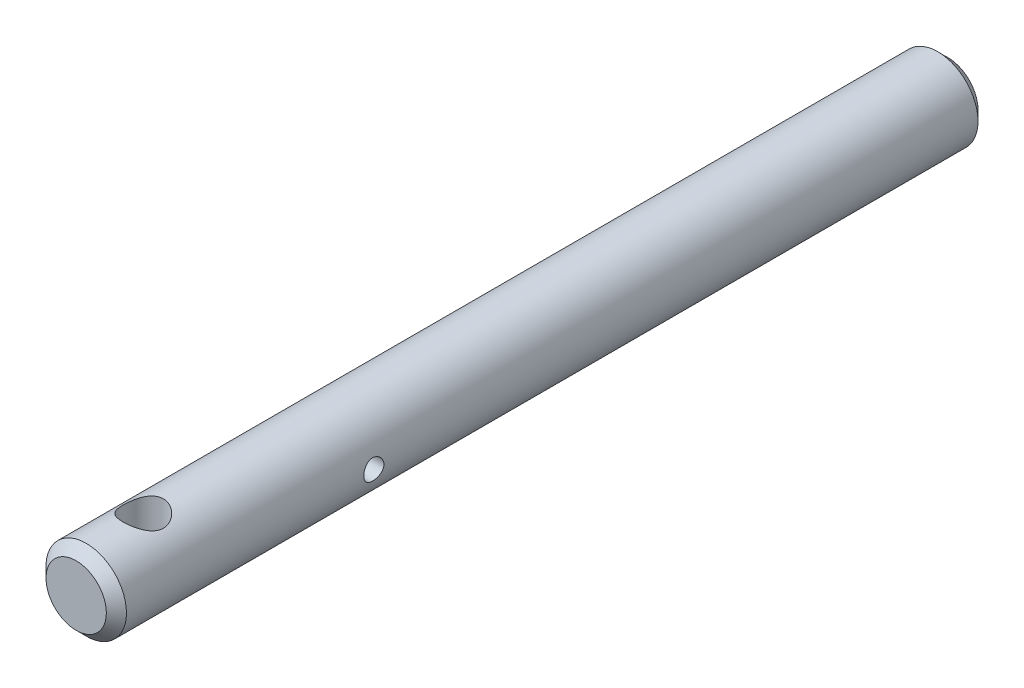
ISO-10303-21;
HEADER;
FILE_DESCRIPTION(('STEP AP214'),'2;1');
FILE_NAME('part.step','',(''),(''),'','','');
FILE_SCHEMA(('AUTOMOTIVE_DESIGN { 1 0 10303 214 1 1 1 1 }'));
ENDSEC;
DATA;
#1=APPLICATION_CONTEXT('core data for automotive mechanical design processes');
#2=APPLICATION_PROTOCOL_DEFINITION('international standard','automotive_design',2000,#1);
#3=PRODUCT_CONTEXT('',#1,'mechanical');
#4=PRODUCT('Part','Part','',(#3));
#5=PRODUCT_RELATED_PRODUCT_CATEGORY('part','',(#4));
#6=PRODUCT_DEFINITION_FORMATION('','',#4);
#7=PRODUCT_DEFINITION_CONTEXT('part definition',#1,'design');
#8=PRODUCT_DEFINITION('design','',#6,#7);
#9=PRODUCT_DEFINITION_SHAPE('','',#8);
#10=(LENGTH_UNIT() NAMED_UNIT(*) SI_UNIT(.MILLI.,.METRE.));
#11=(NAMED_UNIT(*) PLANE_ANGLE_UNIT() SI_UNIT($,.RADIAN.));
#12=(NAMED_UNIT(*) SI_UNIT($,.STERADIAN.) SOLID_ANGLE_UNIT());
#13=UNCERTAINTY_MEASURE_WITH_UNIT(LENGTH_MEASURE(1.E-05),#10,'distance_accuracy_value','');
#14=(GEOMETRIC_REPRESENTATION_CONTEXT(3) GLOBAL_UNCERTAINTY_ASSIGNED_CONTEXT((#13)) GLOBAL_UNIT_ASSIGNED_CONTEXT((#10,
#11,#12)) REPRESENTATION_CONTEXT('',''));
#15=CARTESIAN_POINT('',(0.,0.,0.));
#16=DIRECTION('',(0.,0.,1.));
#17=DIRECTION('',(1.,0.,0.));
#18=AXIS2_PLACEMENT_3D('',#15,#16,#17);
#19=CARTESIAN_POINT('',(0.,0.,-130.));
#20=DIRECTION('',(0.,0.,1.));
#21=DIRECTION('',(1.,0.,0.));
#22=AXIS2_PLACEMENT_3D('',#19,#20,#21);
#23=CYLINDRICAL_SURFACE('',#22,6.);
#24=CARTESIAN_POINT('',(6.,0.,-39.9));
#25=CARTESIAN_POINT('',(5.99999859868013,0.0828760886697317,-39.8999976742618));
#26=CARTESIAN_POINT('',(5.99826578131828,0.165778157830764,-39.8931084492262));
#27=CARTESIAN_POINT('',(5.99152113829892,0.329206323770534,-39.865774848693));
#28=CARTESIAN_POINT('',(5.98650745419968,0.40973104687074,-39.8453227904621));
#29=CARTESIAN_POINT('',(5.9737562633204,0.566020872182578,-39.7915607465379));
#30=CARTESIAN_POINT('',(5.96602202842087,0.641791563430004,-39.7582662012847));
#31=CARTESIAN_POINT('',(5.94865343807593,0.786672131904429,-39.6798186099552));
#32=CARTESIAN_POINT('',(5.9390190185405,0.855781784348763,-39.6346651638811));
#33=CARTESIAN_POINT('',(5.91867413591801,0.986801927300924,-39.5327992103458));
#34=CARTESIAN_POINT('',(5.90794707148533,1.04855569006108,-39.4758884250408));
#35=CARTESIAN_POINT('',(5.8867362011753,1.16174892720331,-39.3525477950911));
#36=CARTESIAN_POINT('',(5.87625242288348,1.21318723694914,-39.2861168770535));
#37=CARTESIAN_POINT('',(5.8565477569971,1.30502654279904,-39.1444047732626));
#38=CARTESIAN_POINT('',(5.84734794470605,1.34525221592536,-39.0690067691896));
#39=CARTESIAN_POINT('',(5.83149494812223,1.41239690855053,-38.9122515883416));
#40=CARTESIAN_POINT('',(5.82484135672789,1.43931805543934,-38.8308953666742));
#41=CARTESIAN_POINT('',(5.81500476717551,1.47855483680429,-38.6662565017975));
#42=CARTESIAN_POINT('',(5.81175491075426,1.49115226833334,-38.5830451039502));
#43=CARTESIAN_POINT('',(5.80889362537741,1.50226177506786,-38.415631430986));
#44=CARTESIAN_POINT('',(5.80928160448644,1.50077614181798,-38.3314293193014));
#45=CARTESIAN_POINT('',(5.81359205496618,1.48398652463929,-38.1665841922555));
#46=CARTESIAN_POINT('',(5.81742863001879,1.46901834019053,-38.0859043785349));
#47=CARTESIAN_POINT('',(5.82806709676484,1.42622418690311,-37.9282389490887));
#48=CARTESIAN_POINT('',(5.83486919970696,1.39839730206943,-37.851253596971));
#49=CARTESIAN_POINT('',(5.85075113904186,1.33038947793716,-37.7022619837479));
#50=CARTESIAN_POINT('',(5.85985327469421,1.29008666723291,-37.6303138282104));
#51=CARTESIAN_POINT('',(5.87929710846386,1.19835627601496,-37.4940812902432));
#52=CARTESIAN_POINT('',(5.88963902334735,1.14692674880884,-37.4297982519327));
#53=CARTESIAN_POINT('',(5.91075880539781,1.03266342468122,-37.3087963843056));
#54=CARTESIAN_POINT('',(5.92154069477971,0.969546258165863,-37.2523455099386));
#55=CARTESIAN_POINT('',(5.94205965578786,0.834611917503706,-37.1507787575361));
#56=CARTESIAN_POINT('',(5.95179669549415,0.76279447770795,-37.1056632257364));
#57=CARTESIAN_POINT('',(5.96917732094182,0.612115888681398,-37.0279494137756));
#58=CARTESIAN_POINT('',(5.97681360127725,0.533231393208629,-36.9953946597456));
#59=CARTESIAN_POINT('',(5.98907916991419,0.370876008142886,-36.9440826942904));
#60=CARTESIAN_POINT('',(5.99370903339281,0.287405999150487,-36.9253228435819));
#61=CARTESIAN_POINT('',(5.99935499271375,0.120539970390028,-36.9025424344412));
#62=CARTESIAN_POINT('',(6.00046053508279,0.0371967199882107,-36.8981569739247));
#63=CARTESIAN_POINT('',(5.99918804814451,-0.129032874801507,-36.9032490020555));
#64=CARTESIAN_POINT('',(5.99681033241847,-0.211919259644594,-36.9127252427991));
#65=CARTESIAN_POINT('',(5.98889581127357,-0.373614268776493,-36.9449709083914));
#66=CARTESIAN_POINT('',(5.98340634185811,-0.452465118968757,-36.967541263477));
#67=CARTESIAN_POINT('',(5.96988706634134,-0.605257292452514,-37.0251070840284));
#68=CARTESIAN_POINT('',(5.96185700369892,-0.679198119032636,-37.0601038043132));
#69=CARTESIAN_POINT('',(5.9439330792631,-0.821523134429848,-37.1422361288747));
#70=CARTESIAN_POINT('',(5.93400867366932,-0.889785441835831,-37.1895761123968));
#71=CARTESIAN_POINT('',(5.91344509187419,-1.01752661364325,-37.294789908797));
#72=CARTESIAN_POINT('',(5.90280579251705,-1.07700395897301,-37.3526655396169));
#73=CARTESIAN_POINT('',(5.88168956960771,-1.18699056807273,-37.4790019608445));
#74=CARTESIAN_POINT('',(5.87122304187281,-1.23724386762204,-37.5476877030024));
#75=CARTESIAN_POINT('',(5.85192878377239,-1.3255107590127,-37.6927326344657));
#76=CARTESIAN_POINT('',(5.84310098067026,-1.36352489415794,-37.7690914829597));
#77=CARTESIAN_POINT('',(5.82818094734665,-1.42595142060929,-37.9269057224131));
#78=CARTESIAN_POINT('',(5.82207255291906,-1.45044439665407,-38.008327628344));
#79=CARTESIAN_POINT('',(5.81326744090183,-1.48534565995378,-38.1743096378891));
#80=CARTESIAN_POINT('',(5.81056997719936,-1.49575702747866,-38.2588690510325));
#81=CARTESIAN_POINT('',(5.80894901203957,-1.502038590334,-38.4261210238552));
#82=CARTESIAN_POINT('',(5.80991932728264,-1.49831789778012,-38.5087974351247));
#83=CARTESIAN_POINT('',(5.81527909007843,-1.47737727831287,-38.672303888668));
#84=CARTESIAN_POINT('',(5.81966846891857,-1.46015762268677,-38.7531339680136));
#85=CARTESIAN_POINT('',(5.83131260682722,-1.4129313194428,-38.9102084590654));
#86=CARTESIAN_POINT('',(5.83855015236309,-1.38300140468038,-38.9864773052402));
#87=CARTESIAN_POINT('',(5.85507755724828,-1.31126491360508,-39.1329653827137));
#88=CARTESIAN_POINT('',(5.86436770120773,-1.26945669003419,-39.2031837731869));
#89=CARTESIAN_POINT('',(5.88425634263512,-1.17386774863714,-39.337554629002));
#90=CARTESIAN_POINT('',(5.89488264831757,-1.11980316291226,-39.401501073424));
#91=CARTESIAN_POINT('',(5.91608027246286,-1.00178937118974,-39.5195470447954));
#92=CARTESIAN_POINT('',(5.9266515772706,-0.937837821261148,-39.573644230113));
#93=CARTESIAN_POINT('',(5.94677655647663,-0.800467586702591,-39.6714113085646));
#94=CARTESIAN_POINT('',(5.95630833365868,-0.726898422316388,-39.7148746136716));
#95=CARTESIAN_POINT('',(5.97304924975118,-0.573266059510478,-39.7887474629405));
#96=CARTESIAN_POINT('',(5.98026005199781,-0.493207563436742,-39.8191663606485));
#97=CARTESIAN_POINT('',(5.99048059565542,-0.344410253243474,-39.8615718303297));
#98=CARTESIAN_POINT('',(5.99402585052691,-0.27638017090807,-39.8759512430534));
#99=CARTESIAN_POINT('',(5.99878605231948,-0.138906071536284,-39.8951659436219));
#100=CARTESIAN_POINT('',(6.00000117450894,-0.0694621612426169,-39.9000019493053));
#101=CARTESIAN_POINT('',(6.,0.,-39.9));
#102=B_SPLINE_CURVE_WITH_KNOTS('',3,(#24,#25,#26,#27,#28,#29,#30,#31,#32,#33,#34,#35,#36,#37,
#38,#39,#40,#41,#42,#43,#44,#45,#46,#47,#48,#49,#50,#51,#52,#53,#54,#55,#56,#57,#58,#59,#60,#61,
#62,#63,#64,#65,#66,#67,#68,#69,#70,#71,#72,#73,#74,#75,#76,#77,#78,#79,#80,#81,#82,#83,#84,#85,
#86,#87,#88,#89,#90,#91,#92,#93,#94,#95,#96,#97,#98,#99,#100,#101),.UNSPECIFIED.,.T.,.F.,(4,2,2,
2,2,2,2,2,2,2,2,2,2,2,2,2,2,2,2,2,2,2,2,2,2,2,2,2,2,2,2,2,2,2,2,2,2,2,4),(0.,0.248373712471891,
0.4968882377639,0.745104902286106,0.993329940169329,1.24614435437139,1.49898729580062,
1.75558647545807,2.01214461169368,2.2635629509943,2.51494038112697,2.76022497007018,
3.00552703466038,3.2533052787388,3.50112690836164,3.7560150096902,4.01091089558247,
4.26668229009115,4.52240473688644,4.77158308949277,5.02073901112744,5.26620274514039,
5.51169127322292,5.76153587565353,6.0114236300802,6.26744509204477,6.5234551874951,
6.77792254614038,7.0323342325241,7.27943780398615,7.52653640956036,7.77216400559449,
8.01782568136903,8.26989576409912,8.5220256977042,8.7787218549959,9.03523363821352,
9.24342242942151,9.45159556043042),.UNSPECIFIED.);
#103=CARTESIAN_POINT('',(6.,0.,-39.9));
#104=VERTEX_POINT('',#103);
#105=EDGE_CURVE('E31',#104,#104,#102,.T.);
#106=ORIENTED_EDGE('',*,*,#105,.F.);
#107=EDGE_LOOP('',(#106));
#108=FACE_BOUND('',#107,.T.);
#109=CARTESIAN_POINT('',(-6.,0.,-39.9));
#110=CARTESIAN_POINT('',(-5.99999859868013,-0.0828760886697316,-39.8999976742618));
#111=CARTESIAN_POINT('',(-5.99826578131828,-0.165778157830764,-39.8931084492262));
#112=CARTESIAN_POINT('',(-5.99152113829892,-0.329206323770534,-39.865774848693));
#113=CARTESIAN_POINT('',(-5.98650745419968,-0.40973104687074,-39.8453227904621));
#114=CARTESIAN_POINT('',(-5.9737562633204,-0.566020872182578,-39.7915607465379));
#115=CARTESIAN_POINT('',(-5.96602202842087,-0.641791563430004,-39.7582662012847));
#116=CARTESIAN_POINT('',(-5.94865343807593,-0.786672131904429,-39.6798186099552));
#117=CARTESIAN_POINT('',(-5.9390190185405,-0.855781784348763,-39.6346651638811));
#118=CARTESIAN_POINT('',(-5.91867413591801,-0.986801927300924,-39.5327992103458));
#119=CARTESIAN_POINT('',(-5.90794707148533,-1.04855569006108,-39.4758884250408));
#120=CARTESIAN_POINT('',(-5.8867362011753,-1.16174892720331,-39.3525477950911));
#121=CARTESIAN_POINT('',(-5.87625242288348,-1.21318723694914,-39.2861168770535));
#122=CARTESIAN_POINT('',(-5.8565477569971,-1.30502654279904,-39.1444047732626));
#123=CARTESIAN_POINT('',(-5.84734794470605,-1.34525221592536,-39.0690067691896));
#124=CARTESIAN_POINT('',(-5.83149494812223,-1.41239690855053,-38.9122515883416));
#125=CARTESIAN_POINT('',(-5.82484135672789,-1.43931805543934,-38.8308953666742));
#126=CARTESIAN_POINT('',(-5.81500476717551,-1.47855483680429,-38.6662565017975));
#127=CARTESIAN_POINT('',(-5.81175491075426,-1.49115226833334,-38.5830451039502));
#128=CARTESIAN_POINT('',(-5.80889362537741,-1.50226177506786,-38.415631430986));
#129=CARTESIAN_POINT('',(-5.80928160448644,-1.50077614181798,-38.3314293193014));
#130=CARTESIAN_POINT('',(-5.81359205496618,-1.48398652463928,-38.1665841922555));
#131=CARTESIAN_POINT('',(-5.81742863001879,-1.46901834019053,-38.0859043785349));
#132=CARTESIAN_POINT('',(-5.82806709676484,-1.42622418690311,-37.9282389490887));
#133=CARTESIAN_POINT('',(-5.83486919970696,-1.39839730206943,-37.851253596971));
#134=CARTESIAN_POINT('',(-5.85075113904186,-1.33038947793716,-37.7022619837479));
#135=CARTESIAN_POINT('',(-5.85985327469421,-1.29008666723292,-37.6303138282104));
#136=CARTESIAN_POINT('',(-5.87929710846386,-1.19835627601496,-37.4940812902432));
#137=CARTESIAN_POINT('',(-5.88963902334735,-1.14692674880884,-37.4297982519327));
#138=CARTESIAN_POINT('',(-5.91075880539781,-1.03266342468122,-37.3087963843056));
#139=CARTESIAN_POINT('',(-5.92154069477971,-0.969546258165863,-37.2523455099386));
#140=CARTESIAN_POINT('',(-5.94205965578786,-0.834611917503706,-37.1507787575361));
#141=CARTESIAN_POINT('',(-5.95179669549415,-0.76279447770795,-37.1056632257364));
#142=CARTESIAN_POINT('',(-5.96917732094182,-0.612115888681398,-37.0279494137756));
#143=CARTESIAN_POINT('',(-5.97681360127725,-0.533231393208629,-36.9953946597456));
#144=CARTESIAN_POINT('',(-5.98907916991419,-0.370876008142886,-36.9440826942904));
#145=CARTESIAN_POINT('',(-5.99370903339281,-0.287405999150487,-36.9253228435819));
#146=CARTESIAN_POINT('',(-5.99935499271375,-0.120539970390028,-36.9025424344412));
#147=CARTESIAN_POINT('',(-6.00046053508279,-0.0371967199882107,-36.8981569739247));
#148=CARTESIAN_POINT('',(-5.99918804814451,0.129032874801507,-36.9032490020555));
#149=CARTESIAN_POINT('',(-5.99681033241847,0.211919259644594,-36.9127252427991));
#150=CARTESIAN_POINT('',(-5.98889581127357,0.373614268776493,-36.9449709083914));
#151=CARTESIAN_POINT('',(-5.98340634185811,0.452465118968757,-36.967541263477));
#152=CARTESIAN_POINT('',(-5.96988706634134,0.605257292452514,-37.0251070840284));
#153=CARTESIAN_POINT('',(-5.96185700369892,0.679198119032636,-37.0601038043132));
#154=CARTESIAN_POINT('',(-5.9439330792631,0.821523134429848,-37.1422361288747));
#155=CARTESIAN_POINT('',(-5.93400867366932,0.889785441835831,-37.1895761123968));
#156=CARTESIAN_POINT('',(-5.91344509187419,1.01752661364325,-37.294789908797));
#157=CARTESIAN_POINT('',(-5.90280579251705,1.07700395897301,-37.3526655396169));
#158=CARTESIAN_POINT('',(-5.88168956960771,1.18699056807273,-37.4790019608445));
#159=CARTESIAN_POINT('',(-5.87122304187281,1.23724386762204,-37.5476877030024));
#160=CARTESIAN_POINT('',(-5.85192878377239,1.3255107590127,-37.6927326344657));
#161=CARTESIAN_POINT('',(-5.84310098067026,1.36352489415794,-37.7690914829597));
#162=CARTESIAN_POINT('',(-5.82818094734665,1.42595142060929,-37.9269057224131));
#163=CARTESIAN_POINT('',(-5.82207255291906,1.45044439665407,-38.008327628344));
#164=CARTESIAN_POINT('',(-5.81326744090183,1.48534565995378,-38.1743096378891));
#165=CARTESIAN_POINT('',(-5.81056997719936,1.49575702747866,-38.2588690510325));
#166=CARTESIAN_POINT('',(-5.80894901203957,1.502038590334,-38.4261210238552));
#167=CARTESIAN_POINT('',(-5.80991932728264,1.49831789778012,-38.5087974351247));
#168=CARTESIAN_POINT('',(-5.81527909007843,1.47737727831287,-38.672303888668));
#169=CARTESIAN_POINT('',(-5.81966846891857,1.46015762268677,-38.7531339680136));
#170=CARTESIAN_POINT('',(-5.83131260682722,1.4129313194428,-38.9102084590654));
#171=CARTESIAN_POINT('',(-5.83855015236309,1.38300140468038,-38.9864773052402));
#172=CARTESIAN_POINT('',(-5.85507755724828,1.31126491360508,-39.1329653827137));
#173=CARTESIAN_POINT('',(-5.86436770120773,1.26945669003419,-39.2031837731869));
#174=CARTESIAN_POINT('',(-5.88425634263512,1.17386774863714,-39.337554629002));
#175=CARTESIAN_POINT('',(-5.89488264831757,1.11980316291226,-39.401501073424));
#176=CARTESIAN_POINT('',(-5.91608027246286,1.00178937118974,-39.5195470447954));
#177=CARTESIAN_POINT('',(-5.9266515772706,0.937837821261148,-39.573644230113));
#178=CARTESIAN_POINT('',(-5.94677655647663,0.80046758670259,-39.6714113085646));
#179=CARTESIAN_POINT('',(-5.95630833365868,0.726898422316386,-39.7148746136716));
#180=CARTESIAN_POINT('',(-5.97304924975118,0.573266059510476,-39.7887474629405));
#181=CARTESIAN_POINT('',(-5.98026005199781,0.493207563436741,-39.8191663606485));
#182=CARTESIAN_POINT('',(-5.99048059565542,0.344410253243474,-39.8615718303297));
#183=CARTESIAN_POINT('',(-5.99402585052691,0.276380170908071,-39.8759512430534));
#184=CARTESIAN_POINT('',(-5.99878605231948,0.138906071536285,-39.8951659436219));
#185=CARTESIAN_POINT('',(-6.00000117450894,0.0694621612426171,-39.9000019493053));
#186=CARTESIAN_POINT('',(-6.,0.,-39.9));
#187=B_SPLINE_CURVE_WITH_KNOTS('',3,(#109,#110,#111,#112,#113,#114,#115,#116,#117,#118,#119,
#120,#121,#122,#123,#124,#125,#126,#127,#128,#129,#130,#131,#132,#133,#134,#135,#136,#137,#138,
#139,#140,#141,#142,#143,#144,#145,#146,#147,#148,#149,#150,#151,#152,#153,#154,#155,#156,#157,
#158,#159,#160,#161,#162,#163,#164,#165,#166,#167,#168,#169,#170,#171,#172,#173,#174,#175,#176,
#177,#178,#179,#180,#181,#182,#183,#184,#185,#186),.UNSPECIFIED.,.T.,.F.,(4,2,2,2,2,2,2,2,2,2,2,
2,2,2,2,2,2,2,2,2,2,2,2,2,2,2,2,2,2,2,2,2,2,2,2,2,2,2,4),(0.,0.248373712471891,
0.496888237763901,0.745104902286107,0.99332994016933,1.24614435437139,1.49898729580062,
1.75558647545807,2.01214461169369,2.2635629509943,2.51494038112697,2.76022497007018,
3.00552703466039,3.25330527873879,3.50112690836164,3.7560150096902,4.01091089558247,
4.26668229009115,4.52240473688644,4.77158308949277,5.02073901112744,5.26620274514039,
5.51169127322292,5.76153587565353,6.0114236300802,6.26744509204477,6.5234551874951,
6.77792254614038,7.0323342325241,7.27943780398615,7.52653640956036,7.77216400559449,
8.01782568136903,8.26989576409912,8.5220256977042,8.7787218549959,9.03523363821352,
9.24342242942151,9.45159556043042),.UNSPECIFIED.);
#188=CARTESIAN_POINT('',(-6.,0.,-39.9));
#189=VERTEX_POINT('',#188);
#190=EDGE_CURVE('E105',#189,#189,#187,.T.);
#191=ORIENTED_EDGE('',*,*,#190,.F.);
#192=EDGE_LOOP('',(#191));
#193=FACE_BOUND('',#192,.T.);
#194=CARTESIAN_POINT('',(0.,-6.,-7.));
#195=CARTESIAN_POINT('',(-0.0788941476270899,-5.99999934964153,-7.00000083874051));
#196=CARTESIAN_POINT('',(-0.15779662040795,-5.99843869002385,-7.00311794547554));
#197=CARTESIAN_POINT('',(-0.315001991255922,-5.99224358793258,-7.01553927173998));
#198=CARTESIAN_POINT('',(-0.393304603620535,-5.98760776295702,-7.02484627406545));
#199=CARTESIAN_POINT('',(-0.626628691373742,-5.96921978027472,-7.06195785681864));
#200=CARTESIAN_POINT('',(-0.779952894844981,-5.95098734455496,-7.09895282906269));
#201=CARTESIAN_POINT('',(-1.07683586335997,-5.90448966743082,-7.19558177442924));
#202=CARTESIAN_POINT('',(-1.22043005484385,-5.87626344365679,-7.25512776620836));
#203=CARTESIAN_POINT('',(-1.49540820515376,-5.81237302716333,-7.39471125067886));
#204=CARTESIAN_POINT('',(-1.62679312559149,-5.77670942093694,-7.47474712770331));
#205=CARTESIAN_POINT('',(-1.88252701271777,-5.69868752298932,-7.65855398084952));
#206=CARTESIAN_POINT('',(-2.0059694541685,-5.65605474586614,-7.76346794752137));
#207=CARTESIAN_POINT('',(-2.23433451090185,-5.56980033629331,-7.99155592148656));
#208=CARTESIAN_POINT('',(-2.33924301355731,-5.5261779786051,-8.11474371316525));
#209=CARTESIAN_POINT('',(-2.53576864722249,-5.43896347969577,-8.38748436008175));
#210=CARTESIAN_POINT('',(-2.62572411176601,-5.39563602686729,-8.53834097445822));
#211=CARTESIAN_POINT('',(-2.7403403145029,-5.33782449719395,-8.77595085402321));
#212=CARTESIAN_POINT('',(-2.77516786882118,-5.31974570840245,-8.85707092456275));
#213=CARTESIAN_POINT('',(-2.83769299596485,-5.28665768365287,-9.02260057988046));
#214=CARTESIAN_POINT('',(-2.86539478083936,-5.27164663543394,-9.10700818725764));
#215=CARTESIAN_POINT('',(-2.91188280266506,-5.24610341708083,-9.27339579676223));
#216=CARTESIAN_POINT('',(-2.93110042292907,-5.23535838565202,-9.35522279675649));
#217=CARTESIAN_POINT('',(-2.9626355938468,-5.21757784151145,-9.5205549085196));
#218=CARTESIAN_POINT('',(-2.9749568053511,-5.21054036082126,-9.60405910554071));
#219=CARTESIAN_POINT('',(-2.99251382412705,-5.20047756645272,-9.77200636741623));
#220=CARTESIAN_POINT('',(-2.99775389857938,-5.19744983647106,-9.85644883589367));
#221=CARTESIAN_POINT('',(-3.00108452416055,-5.19552555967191,-10.0254936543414));
#222=CARTESIAN_POINT('',(-2.99917575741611,-5.19662861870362,-10.1100959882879));
#223=CARTESIAN_POINT('',(-2.98404973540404,-5.20534668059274,-10.3427538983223));
#224=CARTESIAN_POINT('',(-2.96335042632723,-5.21726794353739,-10.4902441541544));
#225=CARTESIAN_POINT('',(-2.90082280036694,-5.25228182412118,-10.7791936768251));
#226=CARTESIAN_POINT('',(-2.85898775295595,-5.2753780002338,-10.9206510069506));
#227=CARTESIAN_POINT('',(-2.75462843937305,-5.33062568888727,-11.1976796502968));
#228=CARTESIAN_POINT('',(-2.69164495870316,-5.36297559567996,-11.3330371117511));
#229=CARTESIAN_POINT('',(-2.54712530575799,-5.43310175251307,-11.591904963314));
#230=CARTESIAN_POINT('',(-2.46558080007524,-5.47088043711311,-11.7154099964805));
#231=CARTESIAN_POINT('',(-2.27419808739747,-5.55339485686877,-11.9635630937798));
#232=CARTESIAN_POINT('',(-2.16208335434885,-5.59840533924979,-12.0863704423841));
#233=CARTESIAN_POINT('',(-1.91866675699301,-5.6864286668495,-12.3122064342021));
#234=CARTESIAN_POINT('',(-1.78735577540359,-5.72944054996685,-12.4152256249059));
#235=CARTESIAN_POINT('',(-1.50154951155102,-5.81105962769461,-12.6030569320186));
#236=CARTESIAN_POINT('',(-1.3462607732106,-5.84936952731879,-12.6868014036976));
#237=CARTESIAN_POINT('',(-1.02139864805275,-5.91473643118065,-12.8262911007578));
#238=CARTESIAN_POINT('',(-0.851836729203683,-5.94180236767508,-12.8820585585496));
#239=CARTESIAN_POINT('',(-0.518299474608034,-5.97973001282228,-12.9594262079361));
#240=CARTESIAN_POINT('',(-0.355024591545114,-5.99174814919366,-12.9834737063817));
#241=CARTESIAN_POINT('',(-0.0263387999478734,-6.00219040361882,-13.0043941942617));
#242=CARTESIAN_POINT('',(0.139071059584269,-6.00062096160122,-13.0012800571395));
#243=CARTESIAN_POINT('',(0.453698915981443,-5.98473576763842,-12.9693799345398));
#244=CARTESIAN_POINT('',(0.603178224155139,-5.97141737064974,-12.9426024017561));
#245=CARTESIAN_POINT('',(0.895220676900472,-5.93466513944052,-12.8672857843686));
#246=CARTESIAN_POINT('',(1.03778305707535,-5.91123019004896,-12.8187443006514));
#247=CARTESIAN_POINT('',(1.31666582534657,-5.85552754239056,-12.7000046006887));
#248=CARTESIAN_POINT('',(1.45269119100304,-5.82302645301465,-12.6292268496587));
#249=CARTESIAN_POINT('',(1.71138408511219,-5.75231922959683,-12.4686773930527));
#250=CARTESIAN_POINT('',(1.83404588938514,-5.71411066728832,-12.3788975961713));
#251=CARTESIAN_POINT('',(2.07530306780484,-5.63124663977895,-12.1727187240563));
#252=CARTESIAN_POINT('',(2.19231623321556,-5.58632654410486,-12.0545713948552));
#253=CARTESIAN_POINT('',(2.40556896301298,-5.49787174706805,-11.8002245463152));
#254=CARTESIAN_POINT('',(2.50179415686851,-5.4543380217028,-11.6640126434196));
#255=CARTESIAN_POINT('',(2.675123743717,-5.3715357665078,-11.3690690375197));
#256=CARTESIAN_POINT('',(2.75107648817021,-5.33257588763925,-11.2095662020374));
#257=CARTESIAN_POINT('',(2.87424847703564,-5.26722216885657,-10.8774697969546));
#258=CARTESIAN_POINT('',(2.92150474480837,-5.24081214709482,-10.7048934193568));
#259=CARTESIAN_POINT('',(2.98158506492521,-5.2068450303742,-10.3692693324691));
#260=CARTESIAN_POINT('',(2.997278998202,-5.19772150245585,-10.2068972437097));
#261=CARTESIAN_POINT('',(3.00206745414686,-5.19496064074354,-9.88165879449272));
#262=CARTESIAN_POINT('',(2.99117350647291,-5.20131659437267,-9.71879267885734));
#263=CARTESIAN_POINT('',(2.94577840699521,-5.22713585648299,-9.41354950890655));
#264=CARTESIAN_POINT('',(2.91362505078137,-5.24529281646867,-9.27069863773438));
#265=CARTESIAN_POINT('',(2.82952596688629,-5.29113050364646,-8.9925755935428));
#266=CARTESIAN_POINT('',(2.77757387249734,-5.3188142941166,-8.85730587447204));
#267=CARTESIAN_POINT('',(2.65144766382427,-5.38285583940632,-8.58812563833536));
#268=CARTESIAN_POINT('',(2.57601505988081,-5.41967139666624,-8.45491703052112));
#269=CARTESIAN_POINT('',(2.40645126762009,-5.49706022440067,-8.2021756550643));
#270=CARTESIAN_POINT('',(2.31231035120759,-5.53763544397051,-8.08265005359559));
#271=CARTESIAN_POINT('',(2.094616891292,-5.62386853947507,-7.84557714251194));
#272=CARTESIAN_POINT('',(1.96888052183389,-5.66954494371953,-7.73003487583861));
#273=CARTESIAN_POINT('',(1.69843715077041,-5.75633712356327,-7.52119885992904));
#274=CARTESIAN_POINT('',(1.55371998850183,-5.79745043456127,-7.42791710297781));
#275=CARTESIAN_POINT('',(1.32452333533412,-5.85251406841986,-7.30682181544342));
#276=CARTESIAN_POINT('',(1.24575314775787,-5.86982524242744,-7.26947979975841));
#277=CARTESIAN_POINT('',(1.08479725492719,-5.90168845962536,-7.20163832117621));
#278=CARTESIAN_POINT('',(1.00261324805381,-5.91624185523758,-7.17113550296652));
#279=CARTESIAN_POINT('',(0.835616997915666,-5.94212690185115,-7.11739274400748));
#280=CARTESIAN_POINT('',(0.750810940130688,-5.95346557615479,-7.09413695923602));
#281=CARTESIAN_POINT('',(0.579142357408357,-5.97260771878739,-7.05511742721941));
#282=CARTESIAN_POINT('',(0.492281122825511,-5.98041334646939,-7.03934910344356));
#283=CARTESIAN_POINT('',(0.337824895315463,-5.99085829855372,-7.01831532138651));
#284=CARTESIAN_POINT('',(0.270495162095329,-5.99428035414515,-7.01145308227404));
#285=CARTESIAN_POINT('',(0.135445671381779,-5.99885151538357,-7.00229499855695));
#286=CARTESIAN_POINT('',(0.0677259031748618,-6.00000055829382,-6.99999927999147));
#287=CARTESIAN_POINT('',(0.,-6.,-7.));
#288=B_SPLINE_CURVE_WITH_KNOTS('',3,(#194,#195,#196,#197,#198,#199,#200,#201,#202,#203,#204,
#205,#206,#207,#208,#209,#210,#211,#212,#213,#214,#215,#216,#217,#218,#219,#220,#221,#222,#223,
#224,#225,#226,#227,#228,#229,#230,#231,#232,#233,#234,#235,#236,#237,#238,#239,#240,#241,#242,
#243,#244,#245,#246,#247,#248,#249,#250,#251,#252,#253,#254,#255,#256,#257,#258,#259,#260,#261,
#262,#263,#264,#265,#266,#267,#268,#269,#270,#271,#272,#273,#274,#275,#276,#277,#278,#279,#280,
#281,#282,#283,#284,#285,#286,#287),.UNSPECIFIED.,.T.,.F.,(4,2,2,2,2,2,2,2,2,2,2,2,2,2,2,2,2,2,
2,2,2,2,2,2,2,2,2,2,2,2,2,2,2,2,2,2,2,2,2,2,2,2,2,2,2,2,4),(0.,0.236611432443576,
0.4733293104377,0.947100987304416,1.41904300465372,1.89094781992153,2.39140181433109,
2.89223525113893,3.43190833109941,3.70192714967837,3.97178599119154,4.2256372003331,
4.47935352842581,4.73291689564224,4.98645606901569,5.43238672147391,5.87845946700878,
6.33492255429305,6.79159098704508,7.30616358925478,7.82098138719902,8.35970601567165,
8.89800185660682,9.3917140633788,9.88519228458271,10.3404225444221,10.7957029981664,
11.2640010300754,11.7324988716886,12.2470036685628,12.7618630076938,13.3016558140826,
13.8407507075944,14.3280945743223,14.8152271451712,15.2559532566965,15.6968212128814,
16.1673090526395,16.6380421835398,17.1659726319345,17.6941868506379,17.9605054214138,
18.2266930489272,18.4922945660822,18.7577335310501,18.9608446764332,19.1639614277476),.UNSPECIFIED.);
#289=CARTESIAN_POINT('',(0.,-6.,-7.));
#290=VERTEX_POINT('',#289);
#291=EDGE_CURVE('E53',#290,#290,#288,.T.);
#292=ORIENTED_EDGE('',*,*,#291,.F.);
#293=EDGE_LOOP('',(#292));
#294=FACE_BOUND('',#293,.T.);
#295=CARTESIAN_POINT('',(0.,6.,-7.));
#296=CARTESIAN_POINT('',(0.0788941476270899,5.99999934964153,-7.00000083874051));
#297=CARTESIAN_POINT('',(0.15779662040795,5.99843869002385,-7.00311794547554));
#298=CARTESIAN_POINT('',(0.315001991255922,5.99224358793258,-7.01553927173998));
#299=CARTESIAN_POINT('',(0.393304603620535,5.98760776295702,-7.02484627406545));
#300=CARTESIAN_POINT('',(0.626628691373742,5.96921978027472,-7.06195785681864));
#301=CARTESIAN_POINT('',(0.779952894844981,5.95098734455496,-7.09895282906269));
#302=CARTESIAN_POINT('',(1.07683586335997,5.90448966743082,-7.19558177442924));
#303=CARTESIAN_POINT('',(1.22043005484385,5.87626344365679,-7.25512776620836));
#304=CARTESIAN_POINT('',(1.49540820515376,5.81237302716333,-7.39471125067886));
#305=CARTESIAN_POINT('',(1.62679312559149,5.77670942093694,-7.47474712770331));
#306=CARTESIAN_POINT('',(1.88252701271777,5.69868752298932,-7.65855398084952));
#307=CARTESIAN_POINT('',(2.0059694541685,5.65605474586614,-7.76346794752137));
#308=CARTESIAN_POINT('',(2.23433451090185,5.56980033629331,-7.99155592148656));
#309=CARTESIAN_POINT('',(2.33924301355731,5.5261779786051,-8.11474371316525));
#310=CARTESIAN_POINT('',(2.53576864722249,5.43896347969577,-8.38748436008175));
#311=CARTESIAN_POINT('',(2.62572411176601,5.39563602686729,-8.53834097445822));
#312=CARTESIAN_POINT('',(2.7403403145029,5.33782449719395,-8.77595085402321));
#313=CARTESIAN_POINT('',(2.77516786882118,5.31974570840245,-8.85707092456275));
#314=CARTESIAN_POINT('',(2.83769299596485,5.28665768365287,-9.02260057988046));
#315=CARTESIAN_POINT('',(2.86539478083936,5.27164663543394,-9.10700818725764));
#316=CARTESIAN_POINT('',(2.91188280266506,5.24610341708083,-9.27339579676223));
#317=CARTESIAN_POINT('',(2.93110042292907,5.23535838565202,-9.35522279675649));
#318=CARTESIAN_POINT('',(2.9626355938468,5.21757784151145,-9.5205549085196));
#319=CARTESIAN_POINT('',(2.9749568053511,5.21054036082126,-9.60405910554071));
#320=CARTESIAN_POINT('',(2.99251382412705,5.20047756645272,-9.77200636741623));
#321=CARTESIAN_POINT('',(2.99775389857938,5.19744983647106,-9.85644883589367));
#322=CARTESIAN_POINT('',(3.00108452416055,5.19552555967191,-10.0254936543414));
#323=CARTESIAN_POINT('',(2.99917575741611,5.19662861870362,-10.1100959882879));
#324=CARTESIAN_POINT('',(2.98404973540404,5.20534668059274,-10.3427538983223));
#325=CARTESIAN_POINT('',(2.96335042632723,5.21726794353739,-10.4902441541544));
#326=CARTESIAN_POINT('',(2.90082280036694,5.25228182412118,-10.7791936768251));
#327=CARTESIAN_POINT('',(2.85898775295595,5.2753780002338,-10.9206510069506));
#328=CARTESIAN_POINT('',(2.75462843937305,5.33062568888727,-11.1976796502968));
#329=CARTESIAN_POINT('',(2.69164495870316,5.36297559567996,-11.3330371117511));
#330=CARTESIAN_POINT('',(2.54712530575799,5.43310175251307,-11.591904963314));
#331=CARTESIAN_POINT('',(2.46558080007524,5.47088043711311,-11.7154099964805));
#332=CARTESIAN_POINT('',(2.27419808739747,5.55339485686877,-11.9635630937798));
#333=CARTESIAN_POINT('',(2.16208335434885,5.59840533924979,-12.0863704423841));
#334=CARTESIAN_POINT('',(1.91866675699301,5.6864286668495,-12.3122064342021));
#335=CARTESIAN_POINT('',(1.78735577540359,5.72944054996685,-12.4152256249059));
#336=CARTESIAN_POINT('',(1.50154951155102,5.81105962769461,-12.6030569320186));
#337=CARTESIAN_POINT('',(1.3462607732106,5.84936952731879,-12.6868014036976));
#338=CARTESIAN_POINT('',(1.02139864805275,5.91473643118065,-12.8262911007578));
#339=CARTESIAN_POINT('',(0.851836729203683,5.94180236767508,-12.8820585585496));
#340=CARTESIAN_POINT('',(0.518299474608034,5.97973001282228,-12.9594262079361));
#341=CARTESIAN_POINT('',(0.355024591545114,5.99174814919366,-12.9834737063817));
#342=CARTESIAN_POINT('',(0.0263387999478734,6.00219040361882,-13.0043941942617));
#343=CARTESIAN_POINT('',(-0.139071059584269,6.00062096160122,-13.0012800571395));
#344=CARTESIAN_POINT('',(-0.453698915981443,5.98473576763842,-12.9693799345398));
#345=CARTESIAN_POINT('',(-0.603178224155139,5.97141737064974,-12.9426024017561));
#346=CARTESIAN_POINT('',(-0.895220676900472,5.93466513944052,-12.8672857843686));
#347=CARTESIAN_POINT('',(-1.03778305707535,5.91123019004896,-12.8187443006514));
#348=CARTESIAN_POINT('',(-1.31666582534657,5.85552754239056,-12.7000046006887));
#349=CARTESIAN_POINT('',(-1.45269119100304,5.82302645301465,-12.6292268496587));
#350=CARTESIAN_POINT('',(-1.71138408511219,5.75231922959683,-12.4686773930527));
#351=CARTESIAN_POINT('',(-1.83404588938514,5.71411066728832,-12.3788975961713));
#352=CARTESIAN_POINT('',(-2.07530306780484,5.63124663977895,-12.1727187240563));
#353=CARTESIAN_POINT('',(-2.19231623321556,5.58632654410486,-12.0545713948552));
#354=CARTESIAN_POINT('',(-2.40556896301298,5.49787174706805,-11.8002245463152));
#355=CARTESIAN_POINT('',(-2.50179415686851,5.4543380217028,-11.6640126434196));
#356=CARTESIAN_POINT('',(-2.675123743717,5.3715357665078,-11.3690690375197));
#357=CARTESIAN_POINT('',(-2.75107648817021,5.33257588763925,-11.2095662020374));
#358=CARTESIAN_POINT('',(-2.87424847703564,5.26722216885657,-10.8774697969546));
#359=CARTESIAN_POINT('',(-2.92150474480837,5.24081214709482,-10.7048934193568));
#360=CARTESIAN_POINT('',(-2.98158506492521,5.2068450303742,-10.3692693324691));
#361=CARTESIAN_POINT('',(-2.997278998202,5.19772150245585,-10.2068972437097));
#362=CARTESIAN_POINT('',(-3.00206745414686,5.19496064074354,-9.88165879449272));
#363=CARTESIAN_POINT('',(-2.99117350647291,5.20131659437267,-9.71879267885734));
#364=CARTESIAN_POINT('',(-2.94577840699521,5.22713585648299,-9.41354950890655));
#365=CARTESIAN_POINT('',(-2.91362505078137,5.24529281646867,-9.27069863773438));
#366=CARTESIAN_POINT('',(-2.82952596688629,5.29113050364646,-8.9925755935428));
#367=CARTESIAN_POINT('',(-2.77757387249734,5.3188142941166,-8.85730587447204));
#368=CARTESIAN_POINT('',(-2.65144766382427,5.38285583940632,-8.58812563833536));
#369=CARTESIAN_POINT('',(-2.57601505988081,5.41967139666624,-8.45491703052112));
#370=CARTESIAN_POINT('',(-2.40645126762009,5.49706022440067,-8.2021756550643));
#371=CARTESIAN_POINT('',(-2.31231035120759,5.53763544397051,-8.08265005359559));
#372=CARTESIAN_POINT('',(-2.094616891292,5.62386853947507,-7.84557714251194));
#373=CARTESIAN_POINT('',(-1.96888052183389,5.66954494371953,-7.73003487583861));
#374=CARTESIAN_POINT('',(-1.69843715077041,5.75633712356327,-7.52119885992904));
#375=CARTESIAN_POINT('',(-1.55371998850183,5.79745043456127,-7.42791710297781));
#376=CARTESIAN_POINT('',(-1.32452333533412,5.85251406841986,-7.30682181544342));
#377=CARTESIAN_POINT('',(-1.24575314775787,5.86982524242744,-7.26947979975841));
#378=CARTESIAN_POINT('',(-1.08479725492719,5.90168845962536,-7.20163832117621));
#379=CARTESIAN_POINT('',(-1.00261324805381,5.91624185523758,-7.17113550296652));
#380=CARTESIAN_POINT('',(-0.835616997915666,5.94212690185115,-7.11739274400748));
#381=CARTESIAN_POINT('',(-0.750810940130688,5.95346557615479,-7.09413695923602));
#382=CARTESIAN_POINT('',(-0.579142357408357,5.97260771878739,-7.05511742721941));
#383=CARTESIAN_POINT('',(-0.492281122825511,5.98041334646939,-7.03934910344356));
#384=CARTESIAN_POINT('',(-0.337824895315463,5.99085829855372,-7.01831532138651));
#385=CARTESIAN_POINT('',(-0.270495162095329,5.99428035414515,-7.01145308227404));
#386=CARTESIAN_POINT('',(-0.135445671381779,5.99885151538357,-7.00229499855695));
#387=CARTESIAN_POINT('',(-0.0677259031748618,6.00000055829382,-6.99999927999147));
#388=CARTESIAN_POINT('',(0.,6.,-7.));
#389=B_SPLINE_CURVE_WITH_KNOTS('',3,(#295,#296,#297,#298,#299,#300,#301,#302,#303,#304,#305,
#306,#307,#308,#309,#310,#311,#312,#313,#314,#315,#316,#317,#318,#319,#320,#321,#322,#323,#324,
#325,#326,#327,#328,#329,#330,#331,#332,#333,#334,#335,#336,#337,#338,#339,#340,#341,#342,#343,
#344,#345,#346,#347,#348,#349,#350,#351,#352,#353,#354,#355,#356,#357,#358,#359,#360,#361,#362,
#363,#364,#365,#366,#367,#368,#369,#370,#371,#372,#373,#374,#375,#376,#377,#378,#379,#380,#381,
#382,#383,#384,#385,#386,#387,#388),.UNSPECIFIED.,.T.,.F.,(4,2,2,2,2,2,2,2,2,2,2,2,2,2,2,2,2,2,
2,2,2,2,2,2,2,2,2,2,2,2,2,2,2,2,2,2,2,2,2,2,2,2,2,2,2,2,4),(0.,0.236611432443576,
0.4733293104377,0.947100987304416,1.41904300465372,1.89094781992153,2.39140181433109,
2.89223525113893,3.43190833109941,3.70192714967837,3.97178599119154,4.2256372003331,
4.47935352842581,4.73291689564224,4.98645606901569,5.43238672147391,5.87845946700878,
6.33492255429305,6.79159098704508,7.30616358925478,7.82098138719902,8.35970601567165,
8.89800185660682,9.3917140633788,9.88519228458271,10.3404225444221,10.7957029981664,
11.2640010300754,11.7324988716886,12.2470036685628,12.7618630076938,13.3016558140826,
13.8407507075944,14.3280945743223,14.8152271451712,15.2559532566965,15.6968212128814,
16.1673090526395,16.6380421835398,17.1659726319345,17.6941868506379,17.9605054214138,
18.2266930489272,18.4922945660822,18.7577335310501,18.9608446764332,19.1639614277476),.UNSPECIFIED.);
#390=CARTESIAN_POINT('',(0.,6.,-7.));
#391=VERTEX_POINT('',#390);
#392=EDGE_CURVE('E47',#391,#391,#389,.T.);
#393=ORIENTED_EDGE('',*,*,#392,.F.);
#394=EDGE_LOOP('',(#393));
#395=FACE_BOUND('',#394,.T.);
#396=CARTESIAN_POINT('',(0.,0.,-128.5));
#397=DIRECTION('',(0.,0.,1.));
#398=DIRECTION('',(1.,0.,0.));
#399=AXIS2_PLACEMENT_3D('',#396,#397,#398);
#400=CIRCLE('',#399,6.);
#401=CARTESIAN_POINT('',(6.,0.,-128.5));
#402=VERTEX_POINT('',#401);
#403=EDGE_CURVE('E43',#402,#402,#400,.T.);
#404=ORIENTED_EDGE('',*,*,#403,.T.);
#405=EDGE_LOOP('',(#404));
#406=FACE_BOUND('',#405,.T.);
#407=CARTESIAN_POINT('',(0.,0.,-1.5));
#408=DIRECTION('',(0.,0.,1.));
#409=DIRECTION('',(1.,0.,0.));
#410=AXIS2_PLACEMENT_3D('',#407,#408,#409);
#411=CIRCLE('',#410,6.);
#412=CARTESIAN_POINT('',(6.,0.,-1.5));
#413=VERTEX_POINT('',#412);
#414=EDGE_CURVE('E86',#413,#413,#411,.F.);
#415=ORIENTED_EDGE('',*,*,#414,.T.);
#416=EDGE_LOOP('',(#415));
#417=FACE_BOUND('',#416,.T.);
#418=ADVANCED_FACE('F27',(#108,#193,#294,#395,#406,#417),#23,.T.);
#419=CARTESIAN_POINT('',(0.,0.,-130.));
#420=DIRECTION('',(0.,0.,1.));
#421=DIRECTION('',(1.,0.,0.));
#422=AXIS2_PLACEMENT_3D('',#419,#420,#421);
#423=PLANE('',#422);
#424=CARTESIAN_POINT('',(0.,0.,-130.));
#425=DIRECTION('',(0.,0.,1.));
#426=DIRECTION('',(1.,0.,0.));
#427=AXIS2_PLACEMENT_3D('',#424,#425,#426);
#428=CIRCLE('',#427,4.49999999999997);
#429=CARTESIAN_POINT('',(4.49999999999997,0.,-130.));
#430=VERTEX_POINT('',#429);
#431=EDGE_CURVE('E38',#430,#430,#428,.F.);
#432=ORIENTED_EDGE('',*,*,#431,.T.);
#433=EDGE_LOOP('',(#432));
#434=FACE_BOUND('',#433,.T.);
#435=ADVANCED_FACE('F74',(#434),#423,.F.);
#436=CARTESIAN_POINT('',(0.,0.,0.));
#437=DIRECTION('',(0.,0.,1.));
#438=DIRECTION('',(1.,0.,0.));
#439=AXIS2_PLACEMENT_3D('',#436,#437,#438);
#440=PLANE('',#439);
#441=CARTESIAN_POINT('',(0.,0.,0.));
#442=DIRECTION('',(0.,0.,1.));
#443=DIRECTION('',(1.,0.,0.));
#444=AXIS2_PLACEMENT_3D('',#441,#442,#443);
#445=CIRCLE('',#444,4.49999999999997);
#446=CARTESIAN_POINT('',(4.49999999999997,0.,0.));
#447=VERTEX_POINT('',#446);
#448=EDGE_CURVE('E10',#447,#447,#445,.T.);
#449=ORIENTED_EDGE('',*,*,#448,.T.);
#450=EDGE_LOOP('',(#449));
#451=FACE_BOUND('',#450,.T.);
#452=ADVANCED_FACE('F71',(#451),#440,.T.);
#453=CARTESIAN_POINT('',(0.,0.,-128.5));
#454=DIRECTION('',(0.,0.,1.));
#455=DIRECTION('',(1.,0.,0.));
#456=AXIS2_PLACEMENT_3D('',#453,#454,#455);
#457=CONICAL_SURFACE('',#456,6.,0.785398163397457);
#458=ORIENTED_EDGE('',*,*,#431,.F.);
#459=EDGE_LOOP('',(#458));
#460=FACE_BOUND('',#459,.T.);
#461=ORIENTED_EDGE('',*,*,#403,.F.);
#462=EDGE_LOOP('',(#461));
#463=FACE_BOUND('',#462,.T.);
#464=ADVANCED_FACE('F67',(#460,#463),#457,.T.);
#465=CARTESIAN_POINT('',(0.,0.,0.));
#466=DIRECTION('',(0.,0.,-1.));
#467=DIRECTION('',(-1.,0.,0.));
#468=AXIS2_PLACEMENT_3D('',#465,#466,#467);
#469=CONICAL_SURFACE('',#468,4.49999999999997,0.785398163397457);
#470=ORIENTED_EDGE('',*,*,#414,.F.);
#471=EDGE_LOOP('',(#470));
#472=FACE_BOUND('',#471,.T.);
#473=ORIENTED_EDGE('',*,*,#448,.F.);
#474=EDGE_LOOP('',(#473));
#475=FACE_BOUND('',#474,.T.);
#476=ADVANCED_FACE('F61',(#472,#475),#469,.T.);
#477=CARTESIAN_POINT('',(0.,-10.,-10.));
#478=DIRECTION('',(0.,1.,0.));
#479=DIRECTION('',(0.,0.,1.));
#480=AXIS2_PLACEMENT_3D('',#477,#478,#479);
#481=CYLINDRICAL_SURFACE('',#480,3.);
#482=ORIENTED_EDGE('',*,*,#291,.T.);
#483=EDGE_LOOP('',(#482));
#484=FACE_BOUND('',#483,.T.);
#485=ORIENTED_EDGE('',*,*,#392,.T.);
#486=EDGE_LOOP('',(#485));
#487=FACE_BOUND('',#486,.T.);
#488=ADVANCED_FACE('F56',(#484,#487),#481,.F.);
#489=CARTESIAN_POINT('',(-10.,0.,-38.4));
#490=DIRECTION('',(1.,0.,0.));
#491=DIRECTION('',(0.,0.,-1.));
#492=AXIS2_PLACEMENT_3D('',#489,#490,#491);
#493=CYLINDRICAL_SURFACE('',#492,1.5);
#494=ORIENTED_EDGE('',*,*,#105,.T.);
#495=EDGE_LOOP('',(#494));
#496=FACE_BOUND('',#495,.T.);
#497=ORIENTED_EDGE('',*,*,#190,.T.);
#498=EDGE_LOOP('',(#497));
#499=FACE_BOUND('',#498,.T.);
#500=ADVANCED_FACE('F60',(#496,#499),#493,.F.);
#501=CLOSED_SHELL('',(#418,#435,#452,#464,#476,#488,#500));
#502=MANIFOLD_SOLID_BREP('B2',#501);
#503=ADVANCED_BREP_SHAPE_REPRESENTATION('',(#18,#502),#14);
#504=SHAPE_DEFINITION_REPRESENTATION(#9,#503);
ENDSEC;
END-ISO-10303-21;
